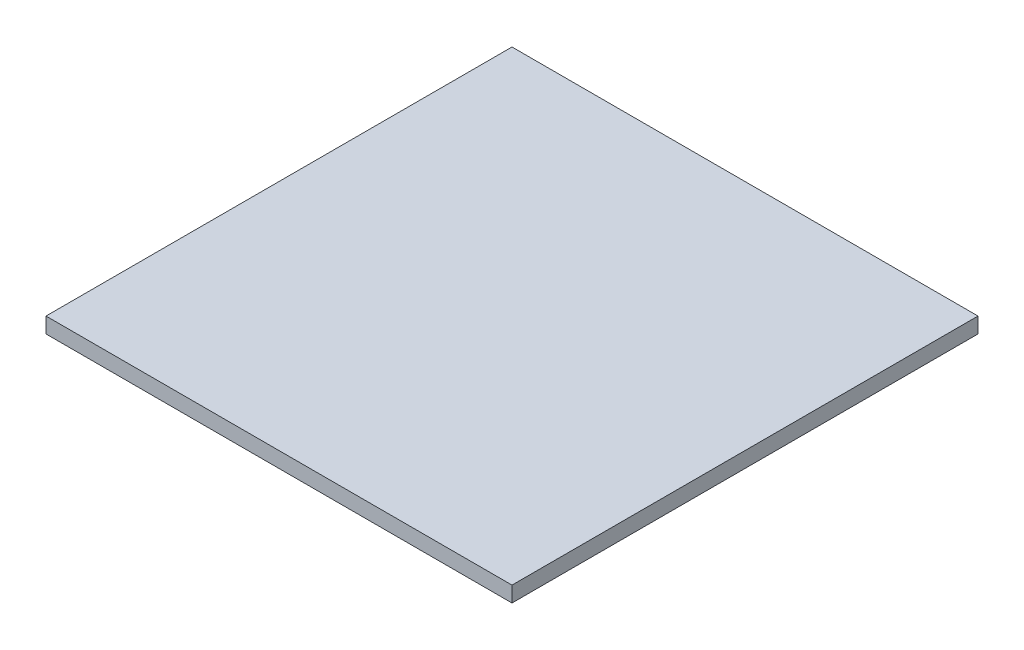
from build123d import *

# Parameters (mm, degrees)
SKETCH1_W           = 300
SKETCH1_H           = 300
BOSS_EXTRUDE1_DEPTH = 10


with BuildPart() as part:
    # Sketch1 → Boss-Extrude1 (new body)
    with BuildSketch(Plane(origin=(0, 0, 0), x_dir=(1, 0, 0), z_dir=(0, 1, 0))):
        with Locations((150, 150)):
            Rectangle(SKETCH1_W, SKETCH1_H)
    extrude(amount=BOSS_EXTRUDE1_DEPTH)


solid = part.part
